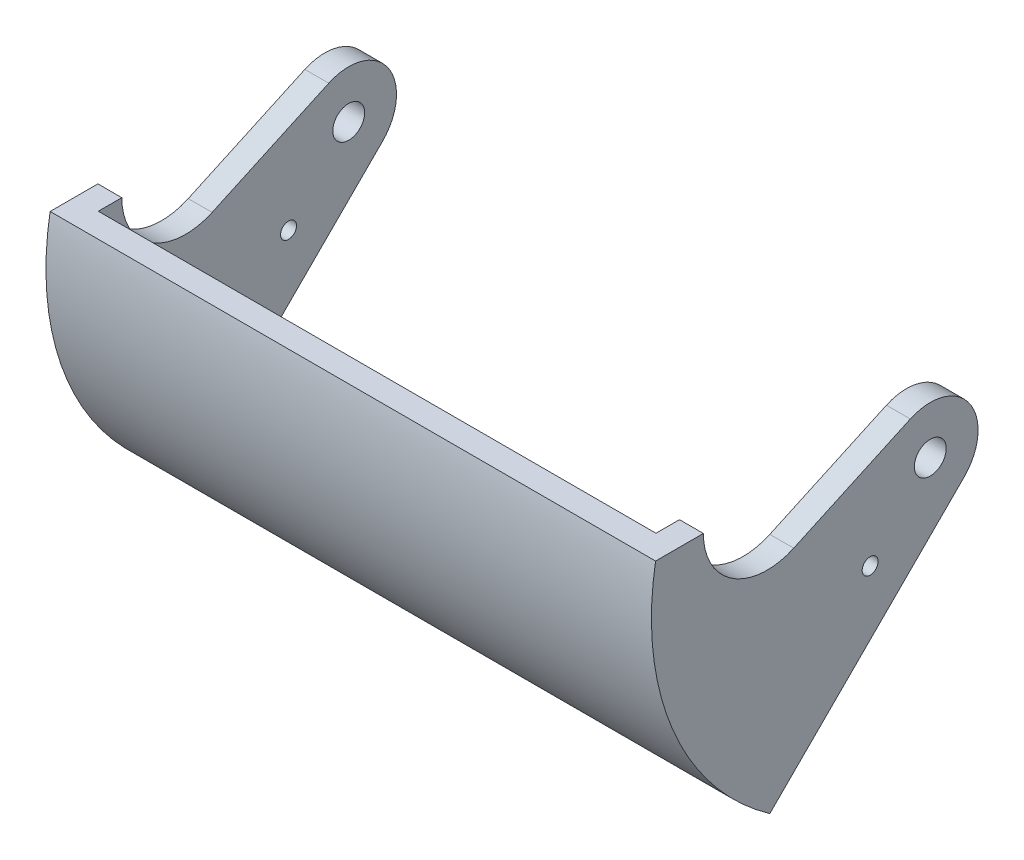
ISO-10303-21;
HEADER;
FILE_DESCRIPTION(('STEP AP214'),'2;1');
FILE_NAME('part.step','',(''),(''),'','','');
FILE_SCHEMA(('AUTOMOTIVE_DESIGN { 1 0 10303 214 1 1 1 1 }'));
ENDSEC;
DATA;
#1=APPLICATION_CONTEXT('core data for automotive mechanical design processes');
#2=APPLICATION_PROTOCOL_DEFINITION('international standard','automotive_design',2000,#1);
#3=PRODUCT_CONTEXT('',#1,'mechanical');
#4=PRODUCT('Part','Part','',(#3));
#5=PRODUCT_RELATED_PRODUCT_CATEGORY('part','',(#4));
#6=PRODUCT_DEFINITION_FORMATION('','',#4);
#7=PRODUCT_DEFINITION_CONTEXT('part definition',#1,'design');
#8=PRODUCT_DEFINITION('design','',#6,#7);
#9=PRODUCT_DEFINITION_SHAPE('','',#8);
#10=(LENGTH_UNIT() NAMED_UNIT(*) SI_UNIT(.MILLI.,.METRE.));
#11=(NAMED_UNIT(*) PLANE_ANGLE_UNIT() SI_UNIT($,.RADIAN.));
#12=(NAMED_UNIT(*) SI_UNIT($,.STERADIAN.) SOLID_ANGLE_UNIT());
#13=UNCERTAINTY_MEASURE_WITH_UNIT(LENGTH_MEASURE(1.E-05),#10,'distance_accuracy_value','');
#14=(GEOMETRIC_REPRESENTATION_CONTEXT(3) GLOBAL_UNCERTAINTY_ASSIGNED_CONTEXT((#13)) GLOBAL_UNIT_ASSIGNED_CONTEXT((#10,
#11,#12)) REPRESENTATION_CONTEXT('',''));
#15=CARTESIAN_POINT('',(0.,0.,0.));
#16=DIRECTION('',(0.,0.,1.));
#17=DIRECTION('',(1.,0.,0.));
#18=AXIS2_PLACEMENT_3D('',#15,#16,#17);
#19=CARTESIAN_POINT('',(38.,0.,0.));
#20=DIRECTION('',(-1.,0.,0.));
#21=DIRECTION('',(0.,0.,1.));
#22=AXIS2_PLACEMENT_3D('',#19,#20,#21);
#23=CYLINDRICAL_SURFACE('',#22,5.99999999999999);
#24=CARTESIAN_POINT('',(-35.,0.,0.));
#25=DIRECTION('',(1.,0.,0.));
#26=DIRECTION('',(0.,0.,-1.));
#27=AXIS2_PLACEMENT_3D('',#24,#25,#26);
#28=CIRCLE('',#27,5.99999999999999);
#29=CARTESIAN_POINT('',(-35.,-4.24264068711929,-4.24264068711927));
#30=VERTEX_POINT('',#29);
#31=CARTESIAN_POINT('',(-35.,5.45256624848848,2.50390121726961));
#32=VERTEX_POINT('',#31);
#33=EDGE_CURVE('E239',#30,#32,#28,.T.);
#34=ORIENTED_EDGE('',*,*,#33,.F.);
#35=DIRECTION('',(-1.,0.,0.));
#36=VECTOR('',#35,1.);
#37=CARTESIAN_POINT('',(38.,-4.24264068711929,-4.24264068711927));
#38=LINE('',#37,#36);
#39=CARTESIAN_POINT('',(-38.,-4.24264068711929,-4.24264068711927));
#40=VERTEX_POINT('',#39);
#41=EDGE_CURVE('E164',#30,#40,#38,.T.);
#42=ORIENTED_EDGE('',*,*,#41,.T.);
#43=CARTESIAN_POINT('',(-38.,0.,0.));
#44=DIRECTION('',(1.,0.,0.));
#45=DIRECTION('',(0.,0.,-1.));
#46=AXIS2_PLACEMENT_3D('',#43,#44,#45);
#47=CIRCLE('',#46,5.99999999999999);
#48=CARTESIAN_POINT('',(-38.,5.45256624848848,2.5039012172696));
#49=VERTEX_POINT('',#48);
#50=EDGE_CURVE('E210',#40,#49,#47,.T.);
#51=ORIENTED_EDGE('',*,*,#50,.T.);
#52=DIRECTION('',(-1.,0.,0.));
#53=VECTOR('',#52,1.);
#54=CARTESIAN_POINT('',(38.,5.45256624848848,2.5039012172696));
#55=LINE('',#54,#53);
#56=EDGE_CURVE('E45',#32,#49,#55,.T.);
#57=ORIENTED_EDGE('',*,*,#56,.F.);
#58=EDGE_LOOP('',(#34,#42,#51,#57));
#59=FACE_BOUND('',#58,.T.);
#60=ADVANCED_FACE('F36',(#59),#23,.T.);
#61=CARTESIAN_POINT('',(38.,-1.27008833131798,17.1433443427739));
#62=DIRECTION('',(0.,-0.908761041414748,-0.417316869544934));
#63=DIRECTION('',(0.,0.417316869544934,-0.908761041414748));
#64=AXIS2_PLACEMENT_3D('',#61,#62,#63);
#65=PLANE('',#64);
#66=DIRECTION('',(0.,-0.417316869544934,0.908761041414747));
#67=VECTOR('',#66,1.);
#68=CARTESIAN_POINT('',(-35.,-1.27008833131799,17.1433443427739));
#69=LINE('',#68,#67);
#70=CARTESIAN_POINT('',(-35.,-1.27008833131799,17.1433443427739));
#71=VERTEX_POINT('',#70);
#72=EDGE_CURVE('E249',#32,#71,#69,.T.);
#73=ORIENTED_EDGE('',*,*,#72,.F.);
#74=ORIENTED_EDGE('',*,*,#56,.T.);
#75=DIRECTION('',(0.,-0.417316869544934,0.908761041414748));
#76=VECTOR('',#75,1.);
#77=CARTESIAN_POINT('',(-38.,-1.27008833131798,17.1433443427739));
#78=LINE('',#77,#76);
#79=CARTESIAN_POINT('',(-38.,-1.27008833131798,17.1433443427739));
#80=VERTEX_POINT('',#79);
#81=EDGE_CURVE('E213',#49,#80,#78,.T.);
#82=ORIENTED_EDGE('',*,*,#81,.T.);
#83=DIRECTION('',(-1.,0.,0.));
#84=VECTOR('',#83,1.);
#85=CARTESIAN_POINT('',(38.,-1.27008833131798,17.1433443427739));
#86=LINE('',#85,#84);
#87=EDGE_CURVE('E176',#71,#80,#86,.T.);
#88=ORIENTED_EDGE('',*,*,#87,.F.);
#89=EDGE_LOOP('',(#73,#74,#82,#88));
#90=FACE_BOUND('',#89,.T.);
#91=ADVANCED_FACE('F274',(#90),#65,.F.);
#92=CARTESIAN_POINT('',(38.,5.99999999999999,20.4818792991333));
#93=DIRECTION('',(-1.,0.,0.));
#94=DIRECTION('',(0.,0.,1.));
#95=AXIS2_PLACEMENT_3D('',#92,#93,#94);
#96=CYLINDRICAL_SURFACE('',#95,8.);
#97=CARTESIAN_POINT('',(-35.,5.99999999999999,20.4818792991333));
#98=DIRECTION('',(-1.,0.,0.));
#99=DIRECTION('',(0.,0.,-1.));
#100=AXIS2_PLACEMENT_3D('',#97,#98,#99);
#101=CIRCLE('',#100,8.);
#102=CARTESIAN_POINT('',(-35.,6.,28.4818792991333));
#103=VERTEX_POINT('',#102);
#104=EDGE_CURVE('E245',#71,#103,#101,.T.);
#105=ORIENTED_EDGE('',*,*,#104,.F.);
#106=ORIENTED_EDGE('',*,*,#87,.T.);
#107=CARTESIAN_POINT('',(-38.,5.99999999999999,20.4818792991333));
#108=DIRECTION('',(-1.,0.,0.));
#109=DIRECTION('',(0.,0.,-1.));
#110=AXIS2_PLACEMENT_3D('',#107,#108,#109);
#111=CIRCLE('',#110,8.);
#112=CARTESIAN_POINT('',(-38.,6.,28.4818792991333));
#113=VERTEX_POINT('',#112);
#114=EDGE_CURVE('E216',#80,#113,#111,.T.);
#115=ORIENTED_EDGE('',*,*,#114,.T.);
#116=DIRECTION('',(-1.,0.,0.));
#117=VECTOR('',#116,1.);
#118=CARTESIAN_POINT('',(38.,6.,28.4818792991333));
#119=LINE('',#118,#117);
#120=EDGE_CURVE('E172',#103,#113,#119,.T.);
#121=ORIENTED_EDGE('',*,*,#120,.F.);
#122=EDGE_LOOP('',(#105,#106,#115,#121));
#123=FACE_BOUND('',#122,.T.);
#124=ADVANCED_FACE('F270',(#123),#96,.F.);
#125=CARTESIAN_POINT('',(38.,5.99999999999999,34.4818792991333));
#126=DIRECTION('',(0.,-1.,0.));
#127=DIRECTION('',(0.,0.,-1.));
#128=AXIS2_PLACEMENT_3D('',#125,#126,#127);
#129=PLANE('',#128);
#130=DIRECTION('',(0.,0.,1.));
#131=VECTOR('',#130,1.);
#132=CARTESIAN_POINT('',(-35.,5.99999999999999,31.4324672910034));
#133=LINE('',#132,#131);
#134=CARTESIAN_POINT('',(-35.,5.99999999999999,31.4324672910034));
#135=VERTEX_POINT('',#134);
#136=EDGE_CURVE('E243',#103,#135,#133,.T.);
#137=ORIENTED_EDGE('',*,*,#136,.F.);
#138=ORIENTED_EDGE('',*,*,#120,.T.);
#139=DIRECTION('',(0.,0.,1.));
#140=VECTOR('',#139,1.);
#141=CARTESIAN_POINT('',(-38.,5.99999999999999,34.4818792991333));
#142=LINE('',#141,#140);
#143=CARTESIAN_POINT('',(-38.,5.99999999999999,34.4818792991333));
#144=VERTEX_POINT('',#143);
#145=EDGE_CURVE('E219',#113,#144,#142,.T.);
#146=ORIENTED_EDGE('',*,*,#145,.T.);
#147=DIRECTION('',(-1.,0.,0.));
#148=VECTOR('',#147,1.);
#149=CARTESIAN_POINT('',(38.,5.99999999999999,34.4818792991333));
#150=LINE('',#149,#148);
#151=CARTESIAN_POINT('',(38.,5.99999999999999,34.4818792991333));
#152=VERTEX_POINT('',#151);
#153=EDGE_CURVE('E169',#152,#144,#150,.T.);
#154=ORIENTED_EDGE('',*,*,#153,.F.);
#155=DIRECTION('',(0.,0.,1.));
#156=VECTOR('',#155,1.);
#157=CARTESIAN_POINT('',(38.,5.99999999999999,34.4818792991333));
#158=LINE('',#157,#156);
#159=CARTESIAN_POINT('',(38.,6.,28.4818792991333));
#160=VERTEX_POINT('',#159);
#161=EDGE_CURVE('E159',#160,#152,#158,.T.);
#162=ORIENTED_EDGE('',*,*,#161,.F.);
#163=CARTESIAN_POINT('',(35.,6.,28.4818792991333));
#164=VERTEX_POINT('',#163);
#165=EDGE_CURVE('E173',#160,#164,#119,.T.);
#166=ORIENTED_EDGE('',*,*,#165,.T.);
#167=DIRECTION('',(0.,0.,1.));
#168=VECTOR('',#167,1.);
#169=CARTESIAN_POINT('',(35.,5.99999999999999,31.4324672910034));
#170=LINE('',#169,#168);
#171=CARTESIAN_POINT('',(35.,5.99999999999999,31.4324672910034));
#172=VERTEX_POINT('',#171);
#173=EDGE_CURVE('E256',#164,#172,#170,.T.);
#174=ORIENTED_EDGE('',*,*,#173,.T.);
#175=DIRECTION('',(1.,0.,0.));
#176=VECTOR('',#175,1.);
#177=CARTESIAN_POINT('',(-35.,5.99999999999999,31.4324672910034));
#178=LINE('',#177,#176);
#179=EDGE_CURVE('E186',#135,#172,#178,.T.);
#180=ORIENTED_EDGE('',*,*,#179,.F.);
#181=EDGE_LOOP('',(#137,#138,#146,#154,#162,#166,#174,#180));
#182=FACE_BOUND('',#181,.T.);
#183=ADVANCED_FACE('F265',(#182),#129,.F.);
#184=CARTESIAN_POINT('',(38.,-4.24264068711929,-4.24264068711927));
#185=DIRECTION('',(0.,0.707106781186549,0.707106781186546));
#186=DIRECTION('',(0.,-0.707106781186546,0.707106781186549));
#187=AXIS2_PLACEMENT_3D('',#184,#185,#186);
#188=PLANE('',#187);
#189=DIRECTION('',(0.,0.707106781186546,-0.707106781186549));
#190=VECTOR('',#189,1.);
#191=CARTESIAN_POINT('',(-35.,-4.24264068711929,-4.24264068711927));
#192=LINE('',#191,#190);
#193=CARTESIAN_POINT('',(-35.,-26.4687514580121,17.9834700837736));
#194=VERTEX_POINT('',#193);
#195=EDGE_CURVE('E190',#194,#30,#192,.T.);
#196=ORIENTED_EDGE('',*,*,#195,.F.);
#197=DIRECTION('',(1.,0.,0.));
#198=VECTOR('',#197,1.);
#199=CARTESIAN_POINT('',(-35.,-26.4687514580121,17.9834700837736));
#200=LINE('',#199,#198);
#201=CARTESIAN_POINT('',(35.,-26.4687514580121,17.9834700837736));
#202=VERTEX_POINT('',#201);
#203=EDGE_CURVE('E180',#194,#202,#200,.T.);
#204=ORIENTED_EDGE('',*,*,#203,.T.);
#205=DIRECTION('',(0.,0.707106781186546,-0.707106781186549));
#206=VECTOR('',#205,1.);
#207=CARTESIAN_POINT('',(35.,-4.24264068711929,-4.24264068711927));
#208=LINE('',#207,#206);
#209=CARTESIAN_POINT('',(35.,-4.24264068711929,-4.24264068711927));
#210=VERTEX_POINT('',#209);
#211=EDGE_CURVE('E252',#202,#210,#208,.T.);
#212=ORIENTED_EDGE('',*,*,#211,.T.);
#213=CARTESIAN_POINT('',(38.,-4.24264068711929,-4.24264068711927));
#214=VERTEX_POINT('',#213);
#215=EDGE_CURVE('E140',#214,#210,#38,.T.);
#216=ORIENTED_EDGE('',*,*,#215,.F.);
#217=DIRECTION('',(0.,0.707106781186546,-0.707106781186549));
#218=VECTOR('',#217,1.);
#219=CARTESIAN_POINT('',(38.,-4.24264068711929,-4.24264068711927));
#220=LINE('',#219,#218);
#221=CARTESIAN_POINT('',(38.,-28.6250113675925,20.139729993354));
#222=VERTEX_POINT('',#221);
#223=EDGE_CURVE('E61',#222,#214,#220,.T.);
#224=ORIENTED_EDGE('',*,*,#223,.F.);
#225=DIRECTION('',(-1.,0.,0.));
#226=VECTOR('',#225,1.);
#227=CARTESIAN_POINT('',(38.,-28.6250113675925,20.139729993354));
#228=LINE('',#227,#226);
#229=CARTESIAN_POINT('',(-38.,-28.6250113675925,20.139729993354));
#230=VERTEX_POINT('',#229);
#231=EDGE_CURVE('E166',#222,#230,#228,.T.);
#232=ORIENTED_EDGE('',*,*,#231,.T.);
#233=DIRECTION('',(0.,0.707106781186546,-0.707106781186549));
#234=VECTOR('',#233,1.);
#235=CARTESIAN_POINT('',(-38.,-4.24264068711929,-4.24264068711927));
#236=LINE('',#235,#234);
#237=EDGE_CURVE('E151',#230,#40,#236,.T.);
#238=ORIENTED_EDGE('',*,*,#237,.T.);
#239=ORIENTED_EDGE('',*,*,#41,.F.);
#240=EDGE_LOOP('',(#196,#204,#212,#216,#224,#232,#238,#239));
#241=FACE_BOUND('',#240,.T.);
#242=ADVANCED_FACE('F229',(#241),#188,.F.);
#243=CARTESIAN_POINT('',(38.,0.,0.));
#244=DIRECTION('',(-1.,0.,0.));
#245=DIRECTION('',(0.,0.,1.));
#246=AXIS2_PLACEMENT_3D('',#243,#244,#245);
#247=CYLINDRICAL_SURFACE('',#246,2.);
#248=CARTESIAN_POINT('',(-38.,0.,0.));
#249=DIRECTION('',(1.,0.,0.));
#250=DIRECTION('',(0.,0.,-1.));
#251=AXIS2_PLACEMENT_3D('',#248,#249,#250);
#252=CIRCLE('',#251,2.);
#253=CARTESIAN_POINT('',(-38.,0.,-2.));
#254=VERTEX_POINT('',#253);
#255=EDGE_CURVE('E204',#254,#254,#252,.T.);
#256=ORIENTED_EDGE('',*,*,#255,.F.);
#257=EDGE_LOOP('',(#256));
#258=FACE_BOUND('',#257,.T.);
#259=CARTESIAN_POINT('',(-35.,0.,0.));
#260=DIRECTION('',(1.,0.,0.));
#261=DIRECTION('',(0.,0.,-1.));
#262=AXIS2_PLACEMENT_3D('',#259,#260,#261);
#263=CIRCLE('',#262,2.);
#264=CARTESIAN_POINT('',(-35.,0.,-2.));
#265=VERTEX_POINT('',#264);
#266=EDGE_CURVE('E195',#265,#265,#263,.T.);
#267=ORIENTED_EDGE('',*,*,#266,.T.);
#268=EDGE_LOOP('',(#267));
#269=FACE_BOUND('',#268,.T.);
#270=ADVANCED_FACE('F312',(#258,#269),#247,.F.);
#271=CARTESIAN_POINT('',(38.,-8.,7.54983443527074));
#272=DIRECTION('',(-1.,0.,0.));
#273=DIRECTION('',(0.,0.,1.));
#274=AXIS2_PLACEMENT_3D('',#271,#272,#273);
#275=CYLINDRICAL_SURFACE('',#274,1.);
#276=CARTESIAN_POINT('',(-38.,-8.,7.54983443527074));
#277=DIRECTION('',(1.,0.,0.));
#278=DIRECTION('',(0.,0.,-1.));
#279=AXIS2_PLACEMENT_3D('',#276,#277,#278);
#280=CIRCLE('',#279,1.);
#281=CARTESIAN_POINT('',(-38.,-8.,6.54983443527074));
#282=VERTEX_POINT('',#281);
#283=EDGE_CURVE('E198',#282,#282,#280,.T.);
#284=ORIENTED_EDGE('',*,*,#283,.F.);
#285=EDGE_LOOP('',(#284));
#286=FACE_BOUND('',#285,.T.);
#287=CARTESIAN_POINT('',(-35.,-8.,7.54983443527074));
#288=DIRECTION('',(1.,0.,0.));
#289=DIRECTION('',(0.,0.,-1.));
#290=AXIS2_PLACEMENT_3D('',#287,#288,#289);
#291=CIRCLE('',#290,1.);
#292=CARTESIAN_POINT('',(-35.,-8.,6.54983443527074));
#293=VERTEX_POINT('',#292);
#294=EDGE_CURVE('E40',#293,#293,#291,.T.);
#295=ORIENTED_EDGE('',*,*,#294,.T.);
#296=EDGE_LOOP('',(#295));
#297=FACE_BOUND('',#296,.T.);
#298=ADVANCED_FACE('F291',(#286,#297),#275,.F.);
#299=CARTESIAN_POINT('',(38.,0.,0.));
#300=DIRECTION('',(1.,0.,0.));
#301=DIRECTION('',(0.,0.,-1.));
#302=AXIS2_PLACEMENT_3D('',#299,#300,#301);
#303=PLANE('',#302);
#304=CARTESIAN_POINT('',(38.,0.,0.));
#305=DIRECTION('',(1.,0.,0.));
#306=DIRECTION('',(0.,0.,-1.));
#307=AXIS2_PLACEMENT_3D('',#304,#305,#306);
#308=CIRCLE('',#307,2.);
#309=CARTESIAN_POINT('',(38.,0.,-2.));
#310=VERTEX_POINT('',#309);
#311=EDGE_CURVE('E207',#310,#310,#308,.T.);
#312=ORIENTED_EDGE('',*,*,#311,.F.);
#313=EDGE_LOOP('',(#312));
#314=FACE_BOUND('',#313,.T.);
#315=CARTESIAN_POINT('',(38.,0.,0.));
#316=DIRECTION('',(1.,0.,0.));
#317=DIRECTION('',(0.,0.,-1.));
#318=AXIS2_PLACEMENT_3D('',#315,#316,#317);
#319=CIRCLE('',#318,5.99999999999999);
#320=CARTESIAN_POINT('',(38.,5.45256624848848,2.5039012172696));
#321=VERTEX_POINT('',#320);
#322=EDGE_CURVE('E147',#214,#321,#319,.T.);
#323=ORIENTED_EDGE('',*,*,#322,.T.);
#324=DIRECTION('',(0.,-0.417316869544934,0.908761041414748));
#325=VECTOR('',#324,1.);
#326=CARTESIAN_POINT('',(38.,-1.27008833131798,17.1433443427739));
#327=LINE('',#326,#325);
#328=CARTESIAN_POINT('',(38.,-1.27008833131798,17.1433443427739));
#329=VERTEX_POINT('',#328);
#330=EDGE_CURVE('E143',#321,#329,#327,.T.);
#331=ORIENTED_EDGE('',*,*,#330,.T.);
#332=CARTESIAN_POINT('',(38.,5.99999999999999,20.4818792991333));
#333=DIRECTION('',(-1.,0.,0.));
#334=DIRECTION('',(0.,0.,-1.));
#335=AXIS2_PLACEMENT_3D('',#332,#333,#334);
#336=CIRCLE('',#335,8.);
#337=EDGE_CURVE('E146',#329,#160,#336,.T.);
#338=ORIENTED_EDGE('',*,*,#337,.T.);
#339=ORIENTED_EDGE('',*,*,#161,.T.);
#340=CARTESIAN_POINT('',(38.,0.,0.));
#341=DIRECTION('',(1.,0.,0.));
#342=DIRECTION('',(0.,0.,-1.));
#343=AXIS2_PLACEMENT_3D('',#340,#341,#342);
#344=CIRCLE('',#343,35.);
#345=EDGE_CURVE('E161',#152,#222,#344,.T.);
#346=ORIENTED_EDGE('',*,*,#345,.T.);
#347=ORIENTED_EDGE('',*,*,#223,.T.);
#348=EDGE_LOOP('',(#323,#331,#338,#339,#346,#347));
#349=FACE_BOUND('',#348,.T.);
#350=CARTESIAN_POINT('',(38.,-8.,7.54983443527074));
#351=DIRECTION('',(1.,0.,0.));
#352=DIRECTION('',(0.,0.,-1.));
#353=AXIS2_PLACEMENT_3D('',#350,#351,#352);
#354=CIRCLE('',#353,1.);
#355=CARTESIAN_POINT('',(38.,-8.,6.54983443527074));
#356=VERTEX_POINT('',#355);
#357=EDGE_CURVE('E201',#356,#356,#354,.T.);
#358=ORIENTED_EDGE('',*,*,#357,.F.);
#359=EDGE_LOOP('',(#358));
#360=FACE_BOUND('',#359,.T.);
#361=ADVANCED_FACE('F149',(#314,#349,#360),#303,.T.);
#362=CARTESIAN_POINT('',(-38.,0.,0.));
#363=DIRECTION('',(1.,0.,0.));
#364=DIRECTION('',(0.,0.,-1.));
#365=AXIS2_PLACEMENT_3D('',#362,#363,#364);
#366=PLANE('',#365);
#367=ORIENTED_EDGE('',*,*,#255,.T.);
#368=EDGE_LOOP('',(#367));
#369=FACE_BOUND('',#368,.T.);
#370=ORIENTED_EDGE('',*,*,#50,.F.);
#371=ORIENTED_EDGE('',*,*,#237,.F.);
#372=CARTESIAN_POINT('',(-38.,0.,0.));
#373=DIRECTION('',(1.,0.,0.));
#374=DIRECTION('',(0.,0.,-1.));
#375=AXIS2_PLACEMENT_3D('',#372,#373,#374);
#376=CIRCLE('',#375,35.);
#377=EDGE_CURVE('E154',#144,#230,#376,.T.);
#378=ORIENTED_EDGE('',*,*,#377,.F.);
#379=ORIENTED_EDGE('',*,*,#145,.F.);
#380=ORIENTED_EDGE('',*,*,#114,.F.);
#381=ORIENTED_EDGE('',*,*,#81,.F.);
#382=EDGE_LOOP('',(#370,#371,#378,#379,#380,#381));
#383=FACE_BOUND('',#382,.T.);
#384=ORIENTED_EDGE('',*,*,#283,.T.);
#385=EDGE_LOOP('',(#384));
#386=FACE_BOUND('',#385,.T.);
#387=ADVANCED_FACE('F232',(#369,#383,#386),#366,.F.);
#388=ORIENTED_EDGE('',*,*,#215,.T.);
#389=CARTESIAN_POINT('',(35.,0.,0.));
#390=DIRECTION('',(1.,0.,0.));
#391=DIRECTION('',(0.,0.,-1.));
#392=AXIS2_PLACEMENT_3D('',#389,#390,#391);
#393=CIRCLE('',#392,5.99999999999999);
#394=CARTESIAN_POINT('',(35.,5.45256624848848,2.50390121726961));
#395=VERTEX_POINT('',#394);
#396=EDGE_CURVE('E53',#210,#395,#393,.T.);
#397=ORIENTED_EDGE('',*,*,#396,.T.);
#398=EDGE_CURVE('E11',#321,#395,#55,.T.);
#399=ORIENTED_EDGE('',*,*,#398,.F.);
#400=ORIENTED_EDGE('',*,*,#322,.F.);
#401=EDGE_LOOP('',(#388,#397,#399,#400));
#402=FACE_BOUND('',#401,.T.);
#403=ADVANCED_FACE('F38',(#402),#23,.T.);
#404=ORIENTED_EDGE('',*,*,#398,.T.);
#405=DIRECTION('',(0.,-0.417316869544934,0.908761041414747));
#406=VECTOR('',#405,1.);
#407=CARTESIAN_POINT('',(35.,-1.27008833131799,17.1433443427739));
#408=LINE('',#407,#406);
#409=CARTESIAN_POINT('',(35.,-1.27008833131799,17.1433443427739));
#410=VERTEX_POINT('',#409);
#411=EDGE_CURVE('E128',#395,#410,#408,.T.);
#412=ORIENTED_EDGE('',*,*,#411,.T.);
#413=EDGE_CURVE('E144',#329,#410,#86,.T.);
#414=ORIENTED_EDGE('',*,*,#413,.F.);
#415=ORIENTED_EDGE('',*,*,#330,.F.);
#416=EDGE_LOOP('',(#404,#412,#414,#415));
#417=FACE_BOUND('',#416,.T.);
#418=ADVANCED_FACE('F142',(#417),#65,.F.);
#419=ORIENTED_EDGE('',*,*,#413,.T.);
#420=CARTESIAN_POINT('',(35.,5.99999999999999,20.4818792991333));
#421=DIRECTION('',(-1.,0.,0.));
#422=DIRECTION('',(0.,0.,-1.));
#423=AXIS2_PLACEMENT_3D('',#420,#421,#422);
#424=CIRCLE('',#423,8.);
#425=EDGE_CURVE('E131',#410,#164,#424,.T.);
#426=ORIENTED_EDGE('',*,*,#425,.T.);
#427=ORIENTED_EDGE('',*,*,#165,.F.);
#428=ORIENTED_EDGE('',*,*,#337,.F.);
#429=EDGE_LOOP('',(#419,#426,#427,#428));
#430=FACE_BOUND('',#429,.T.);
#431=ADVANCED_FACE('F261',(#430),#96,.F.);
#432=CARTESIAN_POINT('',(38.,0.,0.));
#433=DIRECTION('',(-1.,0.,0.));
#434=DIRECTION('',(0.,0.,1.));
#435=AXIS2_PLACEMENT_3D('',#432,#433,#434);
#436=CYLINDRICAL_SURFACE('',#435,35.);
#437=ORIENTED_EDGE('',*,*,#377,.T.);
#438=ORIENTED_EDGE('',*,*,#231,.F.);
#439=ORIENTED_EDGE('',*,*,#345,.F.);
#440=ORIENTED_EDGE('',*,*,#153,.T.);
#441=EDGE_LOOP('',(#437,#438,#439,#440));
#442=FACE_BOUND('',#441,.T.);
#443=ADVANCED_FACE('F223',(#442),#436,.T.);
#444=CARTESIAN_POINT('',(35.,0.,0.));
#445=DIRECTION('',(1.,0.,0.));
#446=DIRECTION('',(0.,0.,-1.));
#447=AXIS2_PLACEMENT_3D('',#444,#445,#446);
#448=CIRCLE('',#447,2.);
#449=CARTESIAN_POINT('',(35.,0.,-2.));
#450=VERTEX_POINT('',#449);
#451=EDGE_CURVE('E179',#450,#450,#448,.T.);
#452=ORIENTED_EDGE('',*,*,#451,.F.);
#453=EDGE_LOOP('',(#452));
#454=FACE_BOUND('',#453,.T.);
#455=ORIENTED_EDGE('',*,*,#311,.T.);
#456=EDGE_LOOP('',(#455));
#457=FACE_BOUND('',#456,.T.);
#458=ADVANCED_FACE('F288',(#454,#457),#247,.F.);
#459=CARTESIAN_POINT('',(35.,-8.,7.54983443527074));
#460=DIRECTION('',(1.,0.,0.));
#461=DIRECTION('',(0.,0.,-1.));
#462=AXIS2_PLACEMENT_3D('',#459,#460,#461);
#463=CIRCLE('',#462,1.);
#464=CARTESIAN_POINT('',(35.,-8.,6.54983443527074));
#465=VERTEX_POINT('',#464);
#466=EDGE_CURVE('E177',#465,#465,#463,.T.);
#467=ORIENTED_EDGE('',*,*,#466,.F.);
#468=EDGE_LOOP('',(#467));
#469=FACE_BOUND('',#468,.T.);
#470=ORIENTED_EDGE('',*,*,#357,.T.);
#471=EDGE_LOOP('',(#470));
#472=FACE_BOUND('',#471,.T.);
#473=ADVANCED_FACE('F280',(#469,#472),#275,.F.);
#474=CARTESIAN_POINT('',(-35.,0.,0.));
#475=DIRECTION('',(1.,0.,0.));
#476=DIRECTION('',(0.,0.,-1.));
#477=AXIS2_PLACEMENT_3D('',#474,#475,#476);
#478=CYLINDRICAL_SURFACE('',#477,32.);
#479=CARTESIAN_POINT('',(35.,0.,0.));
#480=DIRECTION('',(1.,0.,0.));
#481=DIRECTION('',(0.,0.,-1.));
#482=AXIS2_PLACEMENT_3D('',#479,#480,#481);
#483=CIRCLE('',#482,32.);
#484=EDGE_CURVE('E254',#172,#202,#483,.T.);
#485=ORIENTED_EDGE('',*,*,#484,.T.);
#486=ORIENTED_EDGE('',*,*,#203,.F.);
#487=CARTESIAN_POINT('',(-35.,0.,0.));
#488=DIRECTION('',(1.,0.,0.));
#489=DIRECTION('',(0.,0.,-1.));
#490=AXIS2_PLACEMENT_3D('',#487,#488,#489);
#491=CIRCLE('',#490,32.);
#492=EDGE_CURVE('E242',#135,#194,#491,.T.);
#493=ORIENTED_EDGE('',*,*,#492,.F.);
#494=ORIENTED_EDGE('',*,*,#179,.T.);
#495=EDGE_LOOP('',(#485,#486,#493,#494));
#496=FACE_BOUND('',#495,.T.);
#497=ADVANCED_FACE('F278',(#496),#478,.F.);
#498=CARTESIAN_POINT('',(-35.,0.,0.));
#499=DIRECTION('',(1.,0.,0.));
#500=DIRECTION('',(0.,0.,-1.));
#501=AXIS2_PLACEMENT_3D('',#498,#499,#500);
#502=PLANE('',#501);
#503=ORIENTED_EDGE('',*,*,#266,.F.);
#504=EDGE_LOOP('',(#503));
#505=FACE_BOUND('',#504,.T.);
#506=ORIENTED_EDGE('',*,*,#294,.F.);
#507=EDGE_LOOP('',(#506));
#508=FACE_BOUND('',#507,.T.);
#509=ORIENTED_EDGE('',*,*,#33,.T.);
#510=ORIENTED_EDGE('',*,*,#72,.T.);
#511=ORIENTED_EDGE('',*,*,#104,.T.);
#512=ORIENTED_EDGE('',*,*,#136,.T.);
#513=ORIENTED_EDGE('',*,*,#492,.T.);
#514=ORIENTED_EDGE('',*,*,#195,.T.);
#515=EDGE_LOOP('',(#509,#510,#511,#512,#513,#514));
#516=FACE_BOUND('',#515,.T.);
#517=ADVANCED_FACE('F275',(#505,#508,#516),#502,.T.);
#518=CARTESIAN_POINT('',(35.,0.,0.));
#519=DIRECTION('',(1.,0.,0.));
#520=DIRECTION('',(0.,0.,-1.));
#521=AXIS2_PLACEMENT_3D('',#518,#519,#520);
#522=PLANE('',#521);
#523=ORIENTED_EDGE('',*,*,#451,.T.);
#524=EDGE_LOOP('',(#523));
#525=FACE_BOUND('',#524,.T.);
#526=ORIENTED_EDGE('',*,*,#466,.T.);
#527=EDGE_LOOP('',(#526));
#528=FACE_BOUND('',#527,.T.);
#529=ORIENTED_EDGE('',*,*,#396,.F.);
#530=ORIENTED_EDGE('',*,*,#211,.F.);
#531=ORIENTED_EDGE('',*,*,#484,.F.);
#532=ORIENTED_EDGE('',*,*,#173,.F.);
#533=ORIENTED_EDGE('',*,*,#425,.F.);
#534=ORIENTED_EDGE('',*,*,#411,.F.);
#535=EDGE_LOOP('',(#529,#530,#531,#532,#533,#534));
#536=FACE_BOUND('',#535,.T.);
#537=ADVANCED_FACE('F129',(#525,#528,#536),#522,.F.);
#538=CLOSED_SHELL('',(#60,#91,#124,#183,#242,#270,#298,#361,#387,#403,#418,#431,#443,#458,#473,
#497,#517,#537));
#539=MANIFOLD_SOLID_BREP('B2',#538);
#540=ADVANCED_BREP_SHAPE_REPRESENTATION('',(#18,#539),#14);
#541=SHAPE_DEFINITION_REPRESENTATION(#9,#540);
ENDSEC;
END-ISO-10303-21;
